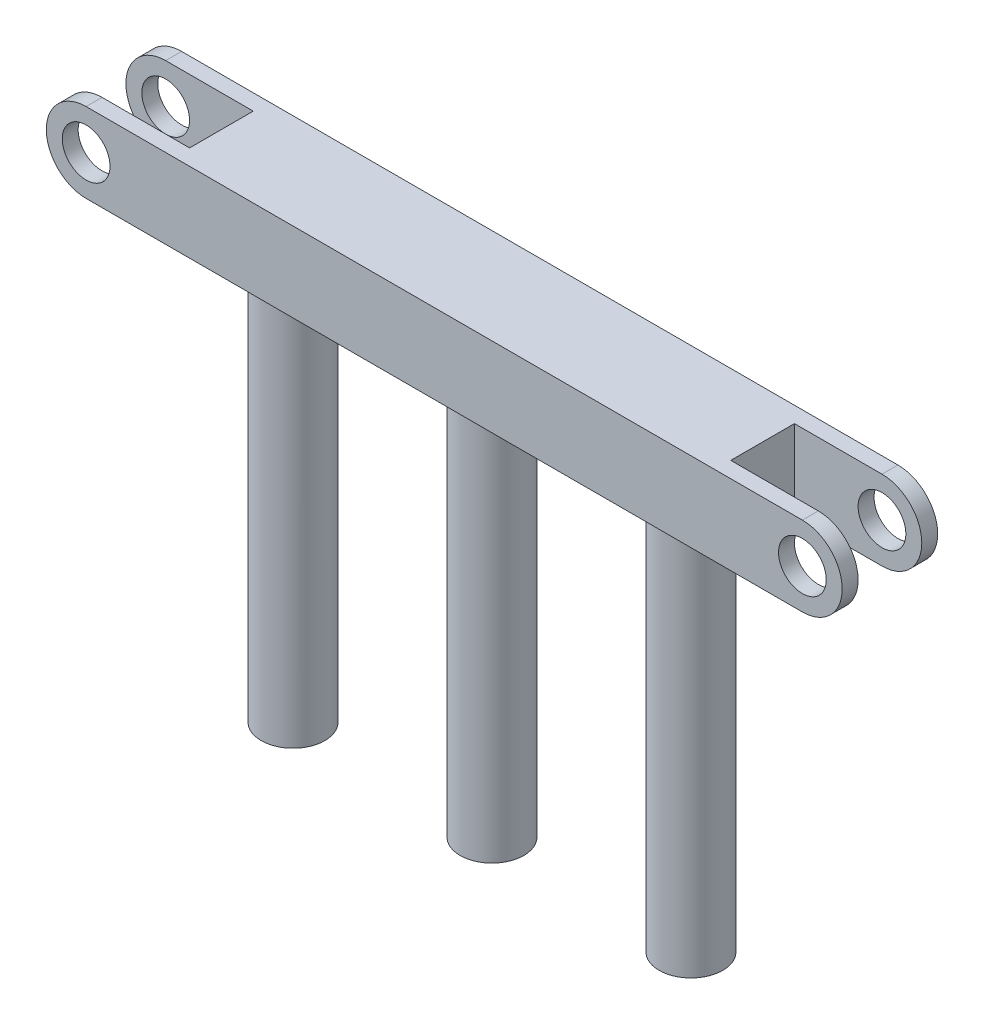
from build123d import *

# Parameters (mm, degrees)
SKETCH1_W          = 50
SKETCH1_H          = 5
EXTRUDE1_DEPTH     = 3
FILLET1_RADIUS     = 2.5
FILLET1_LENGTH     = 6
FILLET2_RADIUS     = 2.5
FILLET2_LENGTH     = 6
SKETCH3_R          = 1.5
CUT_EXTRUDE2_DEPTH = 51.420729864
SKETCH5_W          = 8
SKETCH5_H          = 4
CUT_EXTRUDE4_DEPTH = 51.338851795
SKETCH4_R          = 2
EXTRUDE2_DEPTH     = 30


with BuildPart() as part:
    # Sketch1 → Extrude1 (new, symmetric)
    with BuildSketch(Plane.XY):
        with Locations((25, 0)):
            Rectangle(SKETCH1_W, SKETCH1_H)
    extrude(amount=EXTRUDE1_DEPTH, both=True)

    # Fillet1: full round fillet: the end face becomes a half cylinder, R = half its width
    fillet1_face = Plane((50, 0, 0), x_dir=(0, 0, 1), z_dir=(1, 0, 0))  # on the end face: x along it, z out of the body
    fillet1_slab = fillet1_face.offset(-FILLET1_RADIUS / 2) * Box(FILLET1_LENGTH, 2 * FILLET1_RADIUS, FILLET1_RADIUS, mode=Mode.PRIVATE)  # the body's end, R deep
    fillet1_round = Plane((47.5, 0, 0), x_dir=(1, 0, 0), z_dir=(0, 0, 1)) * Cylinder(FILLET1_RADIUS, FILLET1_LENGTH, mode=Mode.PRIVATE)  # its axis R under the face
    add(fillet1_slab - fillet1_round, mode=Mode.SUBTRACT)

    # Fillet2: full round fillet: the end face becomes a half cylinder, R = half its width
    fillet2_face = Plane((0, 0, 0), x_dir=(0, 0, -1), z_dir=(-1, 0, 0))  # on the end face: x along it, z out of the body
    fillet2_slab = fillet2_face.offset(-FILLET2_RADIUS / 2) * Box(FILLET2_LENGTH, 2 * FILLET2_RADIUS, FILLET2_RADIUS, mode=Mode.PRIVATE)  # the body's end, R deep
    fillet2_round = Plane((2.5, 0, 0), x_dir=(-1, 0, 0), z_dir=(0, 0, -1)) * Cylinder(FILLET2_RADIUS, FILLET2_LENGTH, mode=Mode.PRIVATE)  # its axis R under the face
    add(fillet2_slab - fillet2_round, mode=Mode.SUBTRACT)

    # Sketch3 → Cut-Extrude2 (cut, through all)
    with BuildSketch(Plane.XY.offset(3)):
        with Locations((2.5, 0)):
            Circle(SKETCH3_R)
        with Locations((47.5, 0)):
            Circle(SKETCH3_R)
    extrude(amount=-CUT_EXTRUDE2_DEPTH, mode=Mode.SUBTRACT)

    # Sketch5 → Cut-Extrude4 (cut, through all)
    with BuildSketch(Plane(origin=(0, 2.5, 0), x_dir=(-1, 0, 0), z_dir=(0, 1, 0))):
        with Locations((-4, 0)):
            Rectangle(SKETCH5_W, SKETCH5_H)
        with Locations((-46, 0)):
            Rectangle(SKETCH5_W, SKETCH5_H)
    extrude(amount=-CUT_EXTRUDE4_DEPTH, mode=Mode.SUBTRACT)

    # Sketch4 → Extrude2 (add)
    with BuildSketch(Plane(origin=(0, 2.5, 0), x_dir=(-1, 0, 0), z_dir=(0, 1, 0))):
        with Locations(Location((-37.5, 0, 0), (0, 0, 90))):
            Circle(SKETCH4_R)
        with Locations(Location((-12.5, 0, 0), (0, 0, 90))):
            Circle(SKETCH4_R)
        with Locations(Location((-25, 0, 0), (0, 0, 90))):
            Circle(SKETCH4_R)
    extrude(amount=-EXTRUDE2_DEPTH)


solid = part.part
